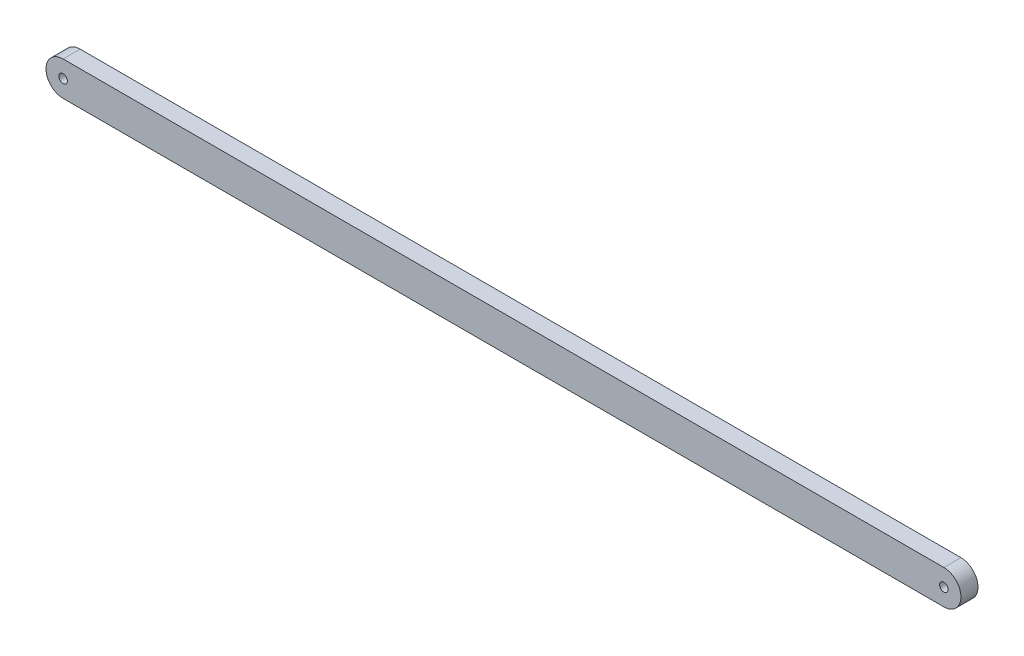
ISO-10303-21;
HEADER;
FILE_DESCRIPTION(('STEP AP214'),'2;1');
FILE_NAME('part.step','',(''),(''),'','','');
FILE_SCHEMA(('AUTOMOTIVE_DESIGN { 1 0 10303 214 1 1 1 1 }'));
ENDSEC;
DATA;
#1=APPLICATION_CONTEXT('core data for automotive mechanical design processes');
#2=APPLICATION_PROTOCOL_DEFINITION('international standard','automotive_design',2000,#1);
#3=PRODUCT_CONTEXT('',#1,'mechanical');
#4=PRODUCT('Part','Part','',(#3));
#5=PRODUCT_RELATED_PRODUCT_CATEGORY('part','',(#4));
#6=PRODUCT_DEFINITION_FORMATION('','',#4);
#7=PRODUCT_DEFINITION_CONTEXT('part definition',#1,'design');
#8=PRODUCT_DEFINITION('design','',#6,#7);
#9=PRODUCT_DEFINITION_SHAPE('','',#8);
#10=(LENGTH_UNIT() NAMED_UNIT(*) SI_UNIT(.MILLI.,.METRE.));
#11=(NAMED_UNIT(*) PLANE_ANGLE_UNIT() SI_UNIT($,.RADIAN.));
#12=(NAMED_UNIT(*) SI_UNIT($,.STERADIAN.) SOLID_ANGLE_UNIT());
#13=UNCERTAINTY_MEASURE_WITH_UNIT(LENGTH_MEASURE(1.E-05),#10,'distance_accuracy_value','');
#14=(GEOMETRIC_REPRESENTATION_CONTEXT(3) GLOBAL_UNCERTAINTY_ASSIGNED_CONTEXT((#13)) GLOBAL_UNIT_ASSIGNED_CONTEXT((#10,
#11,#12)) REPRESENTATION_CONTEXT('',''));
#15=CARTESIAN_POINT('',(0.,0.,0.));
#16=DIRECTION('',(0.,0.,1.));
#17=DIRECTION('',(1.,0.,0.));
#18=AXIS2_PLACEMENT_3D('',#15,#16,#17);
#19=CARTESIAN_POINT('',(0.,0.,2.54));
#20=DIRECTION('',(0.,0.,-1.));
#21=DIRECTION('',(-1.,0.,0.));
#22=AXIS2_PLACEMENT_3D('',#19,#20,#21);
#23=CYLINDRICAL_SURFACE('',#22,2.54);
#24=CARTESIAN_POINT('',(0.,0.,0.));
#25=DIRECTION('',(0.,0.,1.));
#26=DIRECTION('',(1.,0.,0.));
#27=AXIS2_PLACEMENT_3D('',#24,#25,#26);
#28=CIRCLE('',#27,2.54);
#29=CARTESIAN_POINT('',(0.,2.54,0.));
#30=VERTEX_POINT('',#29);
#31=CARTESIAN_POINT('',(0.,-2.54,0.));
#32=VERTEX_POINT('',#31);
#33=EDGE_CURVE('E95',#30,#32,#28,.T.);
#34=ORIENTED_EDGE('',*,*,#33,.T.);
#35=DIRECTION('',(0.,0.,-1.));
#36=VECTOR('',#35,1.);
#37=CARTESIAN_POINT('',(0.,-2.54,2.54));
#38=LINE('',#37,#36);
#39=CARTESIAN_POINT('',(0.,-2.54,2.54));
#40=VERTEX_POINT('',#39);
#41=EDGE_CURVE('E11',#40,#32,#38,.T.);
#42=ORIENTED_EDGE('',*,*,#41,.F.);
#43=CARTESIAN_POINT('',(0.,0.,2.54));
#44=DIRECTION('',(0.,0.,1.));
#45=DIRECTION('',(1.,0.,0.));
#46=AXIS2_PLACEMENT_3D('',#43,#44,#45);
#47=CIRCLE('',#46,2.54);
#48=CARTESIAN_POINT('',(0.,2.54,2.54));
#49=VERTEX_POINT('',#48);
#50=EDGE_CURVE('E83',#49,#40,#47,.T.);
#51=ORIENTED_EDGE('',*,*,#50,.F.);
#52=DIRECTION('',(0.,0.,-1.));
#53=VECTOR('',#52,1.);
#54=CARTESIAN_POINT('',(0.,2.54,2.54));
#55=LINE('',#54,#53);
#56=EDGE_CURVE('E91',#49,#30,#55,.T.);
#57=ORIENTED_EDGE('',*,*,#56,.T.);
#58=EDGE_LOOP('',(#34,#42,#51,#57));
#59=FACE_BOUND('',#58,.T.);
#60=ADVANCED_FACE('F32',(#59),#23,.T.);
#61=CARTESIAN_POINT('',(0.,-2.54,2.54));
#62=DIRECTION('',(0.,1.,0.));
#63=DIRECTION('',(0.,0.,1.));
#64=AXIS2_PLACEMENT_3D('',#61,#62,#63);
#65=PLANE('',#64);
#66=DIRECTION('',(1.,0.,0.));
#67=VECTOR('',#66,1.);
#68=CARTESIAN_POINT('',(0.,-2.54,0.));
#69=LINE('',#68,#67);
#70=CARTESIAN_POINT('',(131.064,-2.54,0.));
#71=VERTEX_POINT('',#70);
#72=EDGE_CURVE('E87',#32,#71,#69,.T.);
#73=ORIENTED_EDGE('',*,*,#72,.T.);
#74=DIRECTION('',(0.,0.,-1.));
#75=VECTOR('',#74,1.);
#76=CARTESIAN_POINT('',(131.064,-2.54,2.54));
#77=LINE('',#76,#75);
#78=CARTESIAN_POINT('',(131.064,-2.54,2.54));
#79=VERTEX_POINT('',#78);
#80=EDGE_CURVE('E40',#79,#71,#77,.T.);
#81=ORIENTED_EDGE('',*,*,#80,.F.);
#82=DIRECTION('',(1.,0.,0.));
#83=VECTOR('',#82,1.);
#84=CARTESIAN_POINT('',(0.,-2.54,2.54));
#85=LINE('',#84,#83);
#86=EDGE_CURVE('E78',#40,#79,#85,.T.);
#87=ORIENTED_EDGE('',*,*,#86,.F.);
#88=ORIENTED_EDGE('',*,*,#41,.T.);
#89=EDGE_LOOP('',(#73,#81,#87,#88));
#90=FACE_BOUND('',#89,.T.);
#91=ADVANCED_FACE('F86',(#90),#65,.F.);
#92=CARTESIAN_POINT('',(131.064,0.,2.54));
#93=DIRECTION('',(0.,0.,-1.));
#94=DIRECTION('',(-1.,0.,0.));
#95=AXIS2_PLACEMENT_3D('',#92,#93,#94);
#96=CYLINDRICAL_SURFACE('',#95,2.54);
#97=CARTESIAN_POINT('',(131.064,0.,0.));
#98=DIRECTION('',(0.,0.,1.));
#99=DIRECTION('',(1.,0.,0.));
#100=AXIS2_PLACEMENT_3D('',#97,#98,#99);
#101=CIRCLE('',#100,2.54);
#102=CARTESIAN_POINT('',(131.064,2.54,0.));
#103=VERTEX_POINT('',#102);
#104=EDGE_CURVE('E65',#71,#103,#101,.T.);
#105=ORIENTED_EDGE('',*,*,#104,.T.);
#106=DIRECTION('',(0.,0.,-1.));
#107=VECTOR('',#106,1.);
#108=CARTESIAN_POINT('',(131.064,2.54,2.54));
#109=LINE('',#108,#107);
#110=CARTESIAN_POINT('',(131.064,2.54,2.54));
#111=VERTEX_POINT('',#110);
#112=EDGE_CURVE('E88',#111,#103,#109,.T.);
#113=ORIENTED_EDGE('',*,*,#112,.F.);
#114=CARTESIAN_POINT('',(131.064,0.,2.54));
#115=DIRECTION('',(0.,0.,1.));
#116=DIRECTION('',(1.,0.,0.));
#117=AXIS2_PLACEMENT_3D('',#114,#115,#116);
#118=CIRCLE('',#117,2.54);
#119=EDGE_CURVE('E81',#79,#111,#118,.T.);
#120=ORIENTED_EDGE('',*,*,#119,.F.);
#121=ORIENTED_EDGE('',*,*,#80,.T.);
#122=EDGE_LOOP('',(#105,#113,#120,#121));
#123=FACE_BOUND('',#122,.T.);
#124=ADVANCED_FACE('F89',(#123),#96,.T.);
#125=CARTESIAN_POINT('',(0.,2.54,2.54));
#126=DIRECTION('',(0.,-1.,0.));
#127=DIRECTION('',(0.,0.,-1.));
#128=AXIS2_PLACEMENT_3D('',#125,#126,#127);
#129=PLANE('',#128);
#130=DIRECTION('',(-1.,0.,0.));
#131=VECTOR('',#130,1.);
#132=CARTESIAN_POINT('',(0.,2.54,0.));
#133=LINE('',#132,#131);
#134=EDGE_CURVE('E71',#103,#30,#133,.T.);
#135=ORIENTED_EDGE('',*,*,#134,.T.);
#136=ORIENTED_EDGE('',*,*,#56,.F.);
#137=DIRECTION('',(-1.,0.,0.));
#138=VECTOR('',#137,1.);
#139=CARTESIAN_POINT('',(0.,2.54,2.54));
#140=LINE('',#139,#138);
#141=EDGE_CURVE('E48',#111,#49,#140,.T.);
#142=ORIENTED_EDGE('',*,*,#141,.F.);
#143=ORIENTED_EDGE('',*,*,#112,.T.);
#144=EDGE_LOOP('',(#135,#136,#142,#143));
#145=FACE_BOUND('',#144,.T.);
#146=ADVANCED_FACE('F103',(#145),#129,.F.);
#147=CARTESIAN_POINT('',(0.,0.,2.54));
#148=DIRECTION('',(0.,0.,1.));
#149=DIRECTION('',(1.,0.,0.));
#150=AXIS2_PLACEMENT_3D('',#147,#148,#149);
#151=PLANE('',#150);
#152=CARTESIAN_POINT('',(131.064,0.,2.54));
#153=DIRECTION('',(0.,0.,1.));
#154=DIRECTION('',(1.,0.,0.));
#155=AXIS2_PLACEMENT_3D('',#152,#153,#154);
#156=CIRCLE('',#155,0.635);
#157=CARTESIAN_POINT('',(131.699,0.,2.54));
#158=VERTEX_POINT('',#157);
#159=EDGE_CURVE('E114',#158,#158,#156,.F.);
#160=ORIENTED_EDGE('',*,*,#159,.T.);
#161=EDGE_LOOP('',(#160));
#162=FACE_BOUND('',#161,.T.);
#163=CARTESIAN_POINT('',(0.,0.,2.54));
#164=DIRECTION('',(0.,0.,1.));
#165=DIRECTION('',(1.,0.,0.));
#166=AXIS2_PLACEMENT_3D('',#163,#164,#165);
#167=CIRCLE('',#166,0.635);
#168=CARTESIAN_POINT('',(0.635,0.,2.54));
#169=VERTEX_POINT('',#168);
#170=EDGE_CURVE('E98',#169,#169,#167,.T.);
#171=ORIENTED_EDGE('',*,*,#170,.F.);
#172=EDGE_LOOP('',(#171));
#173=FACE_BOUND('',#172,.T.);
#174=ORIENTED_EDGE('',*,*,#50,.T.);
#175=ORIENTED_EDGE('',*,*,#86,.T.);
#176=ORIENTED_EDGE('',*,*,#119,.T.);
#177=ORIENTED_EDGE('',*,*,#141,.T.);
#178=EDGE_LOOP('',(#174,#175,#176,#177));
#179=FACE_BOUND('',#178,.T.);
#180=ADVANCED_FACE('F79',(#162,#173,#179),#151,.T.);
#181=CARTESIAN_POINT('',(0.,0.,0.));
#182=DIRECTION('',(0.,0.,1.));
#183=DIRECTION('',(1.,0.,0.));
#184=AXIS2_PLACEMENT_3D('',#181,#182,#183);
#185=PLANE('',#184);
#186=CARTESIAN_POINT('',(131.064,0.,0.));
#187=DIRECTION('',(0.,0.,-1.));
#188=DIRECTION('',(-1.,0.,0.));
#189=AXIS2_PLACEMENT_3D('',#186,#187,#188);
#190=CIRCLE('',#189,0.635);
#191=CARTESIAN_POINT('',(130.429,0.,0.));
#192=VERTEX_POINT('',#191);
#193=EDGE_CURVE('E117',#192,#192,#190,.T.);
#194=ORIENTED_EDGE('',*,*,#193,.F.);
#195=EDGE_LOOP('',(#194));
#196=FACE_BOUND('',#195,.T.);
#197=CARTESIAN_POINT('',(0.,0.,0.));
#198=DIRECTION('',(0.,0.,1.));
#199=DIRECTION('',(1.,0.,0.));
#200=AXIS2_PLACEMENT_3D('',#197,#198,#199);
#201=CIRCLE('',#200,0.635);
#202=CARTESIAN_POINT('',(0.635,0.,0.));
#203=VERTEX_POINT('',#202);
#204=EDGE_CURVE('E111',#203,#203,#201,.T.);
#205=ORIENTED_EDGE('',*,*,#204,.T.);
#206=EDGE_LOOP('',(#205));
#207=FACE_BOUND('',#206,.T.);
#208=ORIENTED_EDGE('',*,*,#33,.F.);
#209=ORIENTED_EDGE('',*,*,#134,.F.);
#210=ORIENTED_EDGE('',*,*,#104,.F.);
#211=ORIENTED_EDGE('',*,*,#72,.F.);
#212=EDGE_LOOP('',(#208,#209,#210,#211));
#213=FACE_BOUND('',#212,.T.);
#214=ADVANCED_FACE('F106',(#196,#207,#213),#185,.F.);
#215=CARTESIAN_POINT('',(0.,0.,0.));
#216=DIRECTION('',(0.,0.,1.));
#217=DIRECTION('',(1.,0.,0.));
#218=AXIS2_PLACEMENT_3D('',#215,#216,#217);
#219=CYLINDRICAL_SURFACE('',#218,0.635);
#220=ORIENTED_EDGE('',*,*,#170,.T.);
#221=EDGE_LOOP('',(#220));
#222=FACE_BOUND('',#221,.T.);
#223=ORIENTED_EDGE('',*,*,#204,.F.);
#224=EDGE_LOOP('',(#223));
#225=FACE_BOUND('',#224,.T.);
#226=ADVANCED_FACE('F125',(#222,#225),#219,.F.);
#227=CARTESIAN_POINT('',(131.064,0.,0.));
#228=DIRECTION('',(0.,0.,1.));
#229=DIRECTION('',(1.,0.,0.));
#230=AXIS2_PLACEMENT_3D('',#227,#228,#229);
#231=CYLINDRICAL_SURFACE('',#230,0.635);
#232=ORIENTED_EDGE('',*,*,#159,.F.);
#233=EDGE_LOOP('',(#232));
#234=FACE_BOUND('',#233,.T.);
#235=ORIENTED_EDGE('',*,*,#193,.T.);
#236=EDGE_LOOP('',(#235));
#237=FACE_BOUND('',#236,.T.);
#238=ADVANCED_FACE('F121',(#234,#237),#231,.F.);
#239=CLOSED_SHELL('',(#60,#91,#124,#146,#180,#214,#226,#238));
#240=MANIFOLD_SOLID_BREP('B2',#239);
#241=ADVANCED_BREP_SHAPE_REPRESENTATION('',(#18,#240),#14);
#242=SHAPE_DEFINITION_REPRESENTATION(#9,#241);
ENDSEC;
END-ISO-10303-21;
